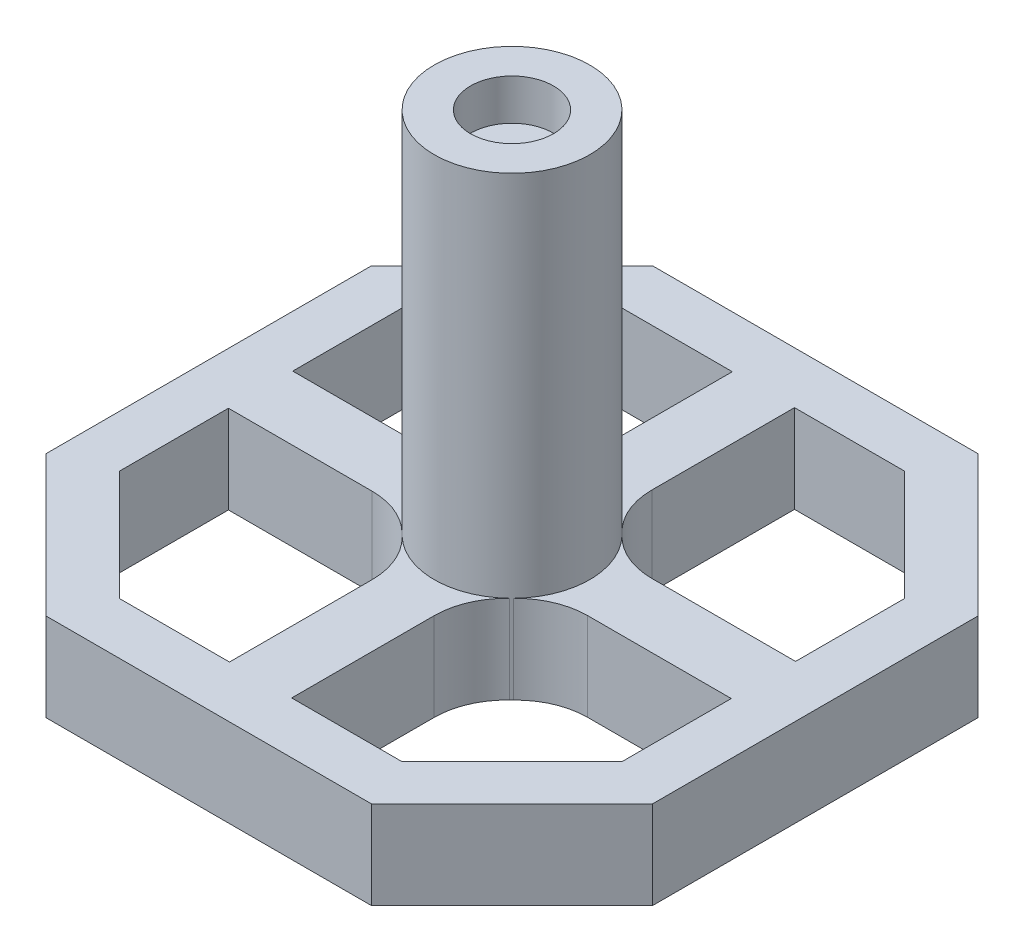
from build123d import *

# Parameters (mm, degrees)
SKETCH2_R             = 3.81
BOSS_EXTRUDE1_DEPTH   = 22.352
ADAPTER_HOLDERS_DEPTH = 4.318
FILLET1_R             = 3.556
SKETCH4_R             = 2.032
MAGNET_HOLE_DEPTH     = 2.0066


with BuildPart() as part:
    # Sketch2 → Boss-Extrude1 (new body)
    with BuildSketch(Plane(origin=(0, 0, 0), x_dir=(1, 0, 0), z_dir=(0, 1, 0))):
        with Locations(Location((0, 0, 0), (0, 0, 270))):
            Circle(SKETCH2_R)
    extrude(amount=BOSS_EXTRUDE1_DEPTH)

    # Sketch3 → Adapter Holders (add)
    with BuildSketch(Plane.XZ):
        Polygon((7.973602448, -14.859), (-7.973602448, -14.859), (-14.859, -7.973602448), (-14.859, 7.973602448), (-7.973602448, 14.859), (7.973602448, 14.859), (14.859, 7.973602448), (14.859, -7.973602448), align=None)
        Polygon((6.9215, -12.319), (1.524, -12.319), (1.524, 12.319), (6.9215, 12.319), (12.319, 6.9215), (12.319, 1.5748), (-12.319, 1.5748), (-12.319, 6.9215), (-6.9215, 12.319), (-1.524, 12.319), (-1.524, -12.319), (-6.9215, -12.319), (-12.319, -6.9215), (-12.319, -1.5748), (12.319, -1.5748), (12.319, -6.9215), align=None, mode=Mode.SUBTRACT)
    extrude(amount=-ADAPTER_HOLDERS_DEPTH)

    # Fillet1
    fillet1_edges = [part.edges().sort_by_distance(p)[0] for p in [
        (1.524, 2.159, 3.49192268),
        (-1.524, 2.159, 3.49192268),
        (-3.469309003, 2.159, 1.5748),
        (-3.469309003, 2.159, -1.5748),
        (-1.524, 2.159, -3.49192268),
        (1.524, 2.159, -3.49192268),
        (3.469309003, 2.159, -1.5748),
        (3.469309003, 2.159, 1.5748),
    ]]
    fillet(fillet1_edges, radius=FILLET1_R)

    # Sketch4 → Magnet Hole (cut)
    with BuildSketch(Plane(origin=(0, 22.352, 0), x_dir=(1, 0, 0), z_dir=(0, 1, 0))):
        with Locations(Location((0, 0, 0), (0, 0, 270))):
            Circle(SKETCH4_R)
    extrude(amount=-MAGNET_HOLE_DEPTH, mode=Mode.SUBTRACT)


solid = part.part
